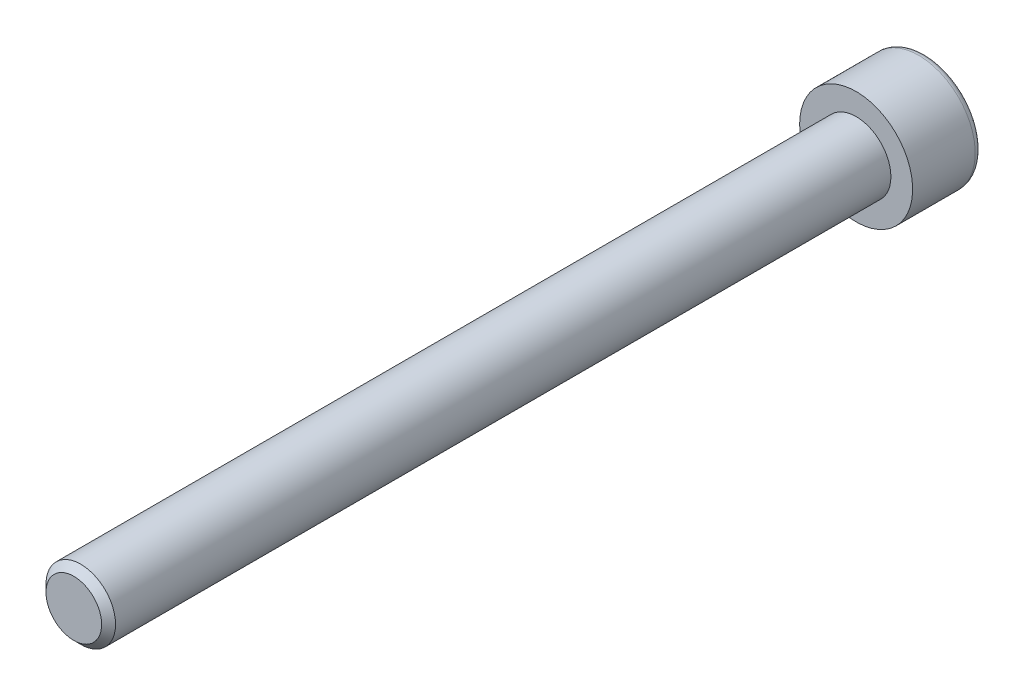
ISO-10303-21;
HEADER;
FILE_DESCRIPTION(('STEP AP214'),'2;1');
FILE_NAME('part.step','',(''),(''),'','','');
FILE_SCHEMA(('AUTOMOTIVE_DESIGN { 1 0 10303 214 1 1 1 1 }'));
ENDSEC;
DATA;
#1=APPLICATION_CONTEXT('core data for automotive mechanical design processes');
#2=APPLICATION_PROTOCOL_DEFINITION('international standard','automotive_design',2000,#1);
#3=PRODUCT_CONTEXT('',#1,'mechanical');
#4=PRODUCT('Part','Part','',(#3));
#5=PRODUCT_RELATED_PRODUCT_CATEGORY('part','',(#4));
#6=PRODUCT_DEFINITION_FORMATION('','',#4);
#7=PRODUCT_DEFINITION_CONTEXT('part definition',#1,'design');
#8=PRODUCT_DEFINITION('design','',#6,#7);
#9=PRODUCT_DEFINITION_SHAPE('','',#8);
#10=(LENGTH_UNIT() NAMED_UNIT(*) SI_UNIT(.MILLI.,.METRE.));
#11=(NAMED_UNIT(*) PLANE_ANGLE_UNIT() SI_UNIT($,.RADIAN.));
#12=(NAMED_UNIT(*) SI_UNIT($,.STERADIAN.) SOLID_ANGLE_UNIT());
#13=UNCERTAINTY_MEASURE_WITH_UNIT(LENGTH_MEASURE(1.E-05),#10,'distance_accuracy_value','');
#14=(GEOMETRIC_REPRESENTATION_CONTEXT(3) GLOBAL_UNCERTAINTY_ASSIGNED_CONTEXT((#13)) GLOBAL_UNIT_ASSIGNED_CONTEXT((#10,
#11,#12)) REPRESENTATION_CONTEXT('',''));
#15=CARTESIAN_POINT('',(0.,0.,0.));
#16=DIRECTION('',(0.,0.,1.));
#17=DIRECTION('',(1.,0.,0.));
#18=AXIS2_PLACEMENT_3D('',#15,#16,#17);
#19=CARTESIAN_POINT('',(0.,0.,-8.));
#20=DIRECTION('',(0.,0.,1.));
#21=DIRECTION('',(1.,0.,0.));
#22=AXIS2_PLACEMENT_3D('',#19,#20,#21);
#23=PLANE('',#22);
#24=CARTESIAN_POINT('',(0.,0.,-8.));
#25=DIRECTION('',(0.,0.,-1.));
#26=DIRECTION('',(-1.,0.,0.));
#27=AXIS2_PLACEMENT_3D('',#24,#25,#26);
#28=CIRCLE('',#27,5.7);
#29=CARTESIAN_POINT('',(-5.7,0.,-8.));
#30=VERTEX_POINT('',#29);
#31=EDGE_CURVE('E458',#30,#30,#28,.T.);
#32=ORIENTED_EDGE('',*,*,#31,.T.);
#33=EDGE_LOOP('',(#32));
#34=FACE_BOUND('',#33,.T.);
#35=DIRECTION('',(-0.86602540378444,0.499999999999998,0.));
#36=VECTOR('',#35,1.);
#37=CARTESIAN_POINT('',(0.,3.46410161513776,-8.));
#38=LINE('',#37,#36);
#39=CARTESIAN_POINT('',(3.,1.73205080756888,-8.));
#40=VERTEX_POINT('',#39);
#41=CARTESIAN_POINT('',(0.,3.46410161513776,-8.));
#42=VERTEX_POINT('',#41);
#43=EDGE_CURVE('E362',#40,#42,#38,.T.);
#44=ORIENTED_EDGE('',*,*,#43,.T.);
#45=DIRECTION('',(-0.866025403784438,-0.500000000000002,0.));
#46=VECTOR('',#45,1.);
#47=CARTESIAN_POINT('',(0.,3.46410161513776,-8.));
#48=LINE('',#47,#46);
#49=CARTESIAN_POINT('',(-3.,1.73205080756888,-8.));
#50=VERTEX_POINT('',#49);
#51=EDGE_CURVE('E402',#42,#50,#48,.T.);
#52=ORIENTED_EDGE('',*,*,#51,.T.);
#53=DIRECTION('',(0.,-1.,0.));
#54=VECTOR('',#53,1.);
#55=CARTESIAN_POINT('',(-3.,-1.73205080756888,-8.));
#56=LINE('',#55,#54);
#57=CARTESIAN_POINT('',(-3.,-1.73205080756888,-8.));
#58=VERTEX_POINT('',#57);
#59=EDGE_CURVE('E410',#50,#58,#56,.T.);
#60=ORIENTED_EDGE('',*,*,#59,.T.);
#61=DIRECTION('',(0.866025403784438,-0.500000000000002,0.));
#62=VECTOR('',#61,1.);
#63=CARTESIAN_POINT('',(0.,-3.46410161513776,-8.));
#64=LINE('',#63,#62);
#65=CARTESIAN_POINT('',(0.,-3.46410161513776,-8.));
#66=VERTEX_POINT('',#65);
#67=EDGE_CURVE('E428',#58,#66,#64,.T.);
#68=ORIENTED_EDGE('',*,*,#67,.T.);
#69=DIRECTION('',(0.86602540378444,0.499999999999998,0.));
#70=VECTOR('',#69,1.);
#71=CARTESIAN_POINT('',(0.,-3.46410161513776,-8.));
#72=LINE('',#71,#70);
#73=CARTESIAN_POINT('',(3.,-1.73205080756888,-8.));
#74=VERTEX_POINT('',#73);
#75=EDGE_CURVE('E431',#66,#74,#72,.T.);
#76=ORIENTED_EDGE('',*,*,#75,.T.);
#77=DIRECTION('',(0.,1.,0.));
#78=VECTOR('',#77,1.);
#79=CARTESIAN_POINT('',(3.,-1.73205080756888,-8.));
#80=LINE('',#79,#78);
#81=EDGE_CURVE('E421',#74,#40,#80,.T.);
#82=ORIENTED_EDGE('',*,*,#81,.T.);
#83=EDGE_LOOP('',(#44,#52,#60,#68,#76,#82));
#84=FACE_BOUND('',#83,.T.);
#85=ADVANCED_FACE('F348',(#34,#84),#23,.F.);
#86=CARTESIAN_POINT('',(0.,0.,-7.2));
#87=DIRECTION('',(0.,0.,-1.));
#88=DIRECTION('',(-1.,0.,0.));
#89=AXIS2_PLACEMENT_3D('',#86,#87,#88);
#90=TOROIDAL_SURFACE('',#89,5.7,0.8);
#91=ORIENTED_EDGE('',*,*,#31,.F.);
#92=EDGE_LOOP('',(#91));
#93=FACE_BOUND('',#92,.T.);
#94=CARTESIAN_POINT('',(0.,0.,-7.2));
#95=DIRECTION('',(0.,0.,-1.));
#96=DIRECTION('',(-1.,0.,0.));
#97=AXIS2_PLACEMENT_3D('',#94,#95,#96);
#98=CIRCLE('',#97,6.5);
#99=CARTESIAN_POINT('',(-6.5,0.,-7.2));
#100=VERTEX_POINT('',#99);
#101=EDGE_CURVE('E455',#100,#100,#98,.T.);
#102=ORIENTED_EDGE('',*,*,#101,.T.);
#103=EDGE_LOOP('',(#102));
#104=FACE_BOUND('',#103,.T.);
#105=ADVANCED_FACE('F477',(#93,#104),#90,.T.);
#106=CARTESIAN_POINT('',(0.,0.,0.));
#107=DIRECTION('',(0.,0.,-1.));
#108=DIRECTION('',(-1.,0.,0.));
#109=AXIS2_PLACEMENT_3D('',#106,#107,#108);
#110=CYLINDRICAL_SURFACE('',#109,6.5);
#111=ORIENTED_EDGE('',*,*,#101,.F.);
#112=EDGE_LOOP('',(#111));
#113=FACE_BOUND('',#112,.T.);
#114=CARTESIAN_POINT('',(0.,0.,0.));
#115=DIRECTION('',(0.,0.,-1.));
#116=DIRECTION('',(-1.,0.,0.));
#117=AXIS2_PLACEMENT_3D('',#114,#115,#116);
#118=CIRCLE('',#117,6.5);
#119=CARTESIAN_POINT('',(-6.5,0.,0.));
#120=VERTEX_POINT('',#119);
#121=EDGE_CURVE('E416',#120,#120,#118,.T.);
#122=ORIENTED_EDGE('',*,*,#121,.T.);
#123=EDGE_LOOP('',(#122));
#124=FACE_BOUND('',#123,.T.);
#125=ADVANCED_FACE('F482',(#113,#124),#110,.T.);
#126=CARTESIAN_POINT('',(0.,0.,0.));
#127=DIRECTION('',(0.,0.,-1.));
#128=DIRECTION('',(-1.,0.,0.));
#129=AXIS2_PLACEMENT_3D('',#126,#127,#128);
#130=PLANE('',#129);
#131=CARTESIAN_POINT('',(0.,0.,0.));
#132=DIRECTION('',(0.,0.,1.));
#133=DIRECTION('',(1.,0.,0.));
#134=AXIS2_PLACEMENT_3D('',#131,#132,#133);
#135=CIRCLE('',#134,4.);
#136=CARTESIAN_POINT('',(4.,0.,0.));
#137=VERTEX_POINT('',#136);
#138=EDGE_CURVE('E422',#137,#137,#135,.T.);
#139=ORIENTED_EDGE('',*,*,#138,.F.);
#140=EDGE_LOOP('',(#139));
#141=FACE_BOUND('',#140,.T.);
#142=ORIENTED_EDGE('',*,*,#121,.F.);
#143=EDGE_LOOP('',(#142));
#144=FACE_BOUND('',#143,.T.);
#145=ADVANCED_FACE('F490',(#141,#144),#130,.F.);
#146=CARTESIAN_POINT('',(0.,3.46410161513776,-3.7));
#147=DIRECTION('',(-0.499999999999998,-0.86602540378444,0.));
#148=DIRECTION('',(0.86602540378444,-0.499999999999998,0.));
#149=AXIS2_PLACEMENT_3D('',#146,#147,#148);
#150=PLANE('',#149);
#151=ORIENTED_EDGE('',*,*,#43,.F.);
#152=DIRECTION('',(0.,0.,-1.));
#153=VECTOR('',#152,1.);
#154=CARTESIAN_POINT('',(3.,1.73205080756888,-3.7));
#155=LINE('',#154,#153);
#156=CARTESIAN_POINT('',(3.,1.73205080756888,-3.7));
#157=VERTEX_POINT('',#156);
#158=EDGE_CURVE('E444',#157,#40,#155,.T.);
#159=ORIENTED_EDGE('',*,*,#158,.F.);
#160=DIRECTION('',(-0.86602540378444,0.499999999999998,0.));
#161=VECTOR('',#160,1.);
#162=CARTESIAN_POINT('',(0.,3.46410161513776,-3.7));
#163=LINE('',#162,#161);
#164=CARTESIAN_POINT('',(0.,3.46410161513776,-3.7));
#165=VERTEX_POINT('',#164);
#166=EDGE_CURVE('E415',#157,#165,#163,.T.);
#167=ORIENTED_EDGE('',*,*,#166,.T.);
#168=DIRECTION('',(0.,0.,-1.));
#169=VECTOR('',#168,1.);
#170=CARTESIAN_POINT('',(0.,3.46410161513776,-3.7));
#171=LINE('',#170,#169);
#172=EDGE_CURVE('E404',#165,#42,#171,.T.);
#173=ORIENTED_EDGE('',*,*,#172,.T.);
#174=EDGE_LOOP('',(#151,#159,#167,#173));
#175=FACE_BOUND('',#174,.T.);
#176=ADVANCED_FACE('F413',(#175),#150,.T.);
#177=CARTESIAN_POINT('',(0.,3.46410161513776,-3.7));
#178=DIRECTION('',(0.500000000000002,-0.866025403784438,0.));
#179=DIRECTION('',(0.866025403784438,0.500000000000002,0.));
#180=AXIS2_PLACEMENT_3D('',#177,#178,#179);
#181=PLANE('',#180);
#182=ORIENTED_EDGE('',*,*,#51,.F.);
#183=ORIENTED_EDGE('',*,*,#172,.F.);
#184=DIRECTION('',(-0.866025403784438,-0.500000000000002,0.));
#185=VECTOR('',#184,1.);
#186=CARTESIAN_POINT('',(0.,3.46410161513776,-3.7));
#187=LINE('',#186,#185);
#188=CARTESIAN_POINT('',(-3.,1.73205080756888,-3.7));
#189=VERTEX_POINT('',#188);
#190=EDGE_CURVE('E435',#165,#189,#187,.T.);
#191=ORIENTED_EDGE('',*,*,#190,.T.);
#192=DIRECTION('',(0.,0.,-1.));
#193=VECTOR('',#192,1.);
#194=CARTESIAN_POINT('',(-3.,1.73205080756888,-3.7));
#195=LINE('',#194,#193);
#196=EDGE_CURVE('E406',#189,#50,#195,.T.);
#197=ORIENTED_EDGE('',*,*,#196,.T.);
#198=EDGE_LOOP('',(#182,#183,#191,#197));
#199=FACE_BOUND('',#198,.T.);
#200=ADVANCED_FACE('F403',(#199),#181,.T.);
#201=CARTESIAN_POINT('',(-3.,-1.73205080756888,-3.7));
#202=DIRECTION('',(1.,0.,0.));
#203=DIRECTION('',(0.,0.,-1.));
#204=AXIS2_PLACEMENT_3D('',#201,#202,#203);
#205=PLANE('',#204);
#206=ORIENTED_EDGE('',*,*,#59,.F.);
#207=ORIENTED_EDGE('',*,*,#196,.F.);
#208=DIRECTION('',(0.,-1.,0.));
#209=VECTOR('',#208,1.);
#210=CARTESIAN_POINT('',(-3.,-1.73205080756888,-3.7));
#211=LINE('',#210,#209);
#212=CARTESIAN_POINT('',(-3.,-1.73205080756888,-3.7));
#213=VERTEX_POINT('',#212);
#214=EDGE_CURVE('E437',#189,#213,#211,.T.);
#215=ORIENTED_EDGE('',*,*,#214,.T.);
#216=DIRECTION('',(0.,0.,-1.));
#217=VECTOR('',#216,1.);
#218=CARTESIAN_POINT('',(-3.,-1.73205080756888,-3.7));
#219=LINE('',#218,#217);
#220=EDGE_CURVE('E450',#213,#58,#219,.T.);
#221=ORIENTED_EDGE('',*,*,#220,.T.);
#222=EDGE_LOOP('',(#206,#207,#215,#221));
#223=FACE_BOUND('',#222,.T.);
#224=ADVANCED_FACE('F505',(#223),#205,.T.);
#225=CARTESIAN_POINT('',(0.,-3.46410161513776,-3.7));
#226=DIRECTION('',(0.500000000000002,0.866025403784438,0.));
#227=DIRECTION('',(-0.866025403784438,0.500000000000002,0.));
#228=AXIS2_PLACEMENT_3D('',#225,#226,#227);
#229=PLANE('',#228);
#230=ORIENTED_EDGE('',*,*,#67,.F.);
#231=ORIENTED_EDGE('',*,*,#220,.F.);
#232=DIRECTION('',(0.866025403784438,-0.500000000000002,0.));
#233=VECTOR('',#232,1.);
#234=CARTESIAN_POINT('',(0.,-3.46410161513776,-3.7));
#235=LINE('',#234,#233);
#236=CARTESIAN_POINT('',(0.,-3.46410161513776,-3.7));
#237=VERTEX_POINT('',#236);
#238=EDGE_CURVE('E439',#213,#237,#235,.T.);
#239=ORIENTED_EDGE('',*,*,#238,.T.);
#240=DIRECTION('',(0.,0.,-1.));
#241=VECTOR('',#240,1.);
#242=CARTESIAN_POINT('',(0.,-3.46410161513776,-3.7));
#243=LINE('',#242,#241);
#244=EDGE_CURVE('E448',#237,#66,#243,.T.);
#245=ORIENTED_EDGE('',*,*,#244,.T.);
#246=EDGE_LOOP('',(#230,#231,#239,#245));
#247=FACE_BOUND('',#246,.T.);
#248=ADVANCED_FACE('F508',(#247),#229,.T.);
#249=CARTESIAN_POINT('',(0.,-3.46410161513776,-3.7));
#250=DIRECTION('',(-0.499999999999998,0.86602540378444,0.));
#251=DIRECTION('',(-0.86602540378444,-0.499999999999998,0.));
#252=AXIS2_PLACEMENT_3D('',#249,#250,#251);
#253=PLANE('',#252);
#254=ORIENTED_EDGE('',*,*,#75,.F.);
#255=ORIENTED_EDGE('',*,*,#244,.F.);
#256=DIRECTION('',(0.86602540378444,0.499999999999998,0.));
#257=VECTOR('',#256,1.);
#258=CARTESIAN_POINT('',(0.,-3.46410161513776,-3.7));
#259=LINE('',#258,#257);
#260=CARTESIAN_POINT('',(3.,-1.73205080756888,-3.7));
#261=VERTEX_POINT('',#260);
#262=EDGE_CURVE('E441',#237,#261,#259,.T.);
#263=ORIENTED_EDGE('',*,*,#262,.T.);
#264=DIRECTION('',(0.,0.,-1.));
#265=VECTOR('',#264,1.);
#266=CARTESIAN_POINT('',(3.,-1.73205080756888,-3.7));
#267=LINE('',#266,#265);
#268=EDGE_CURVE('E446',#261,#74,#267,.T.);
#269=ORIENTED_EDGE('',*,*,#268,.T.);
#270=EDGE_LOOP('',(#254,#255,#263,#269));
#271=FACE_BOUND('',#270,.T.);
#272=ADVANCED_FACE('F512',(#271),#253,.T.);
#273=CARTESIAN_POINT('',(3.,-1.73205080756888,-3.7));
#274=DIRECTION('',(-1.,0.,0.));
#275=DIRECTION('',(0.,0.,1.));
#276=AXIS2_PLACEMENT_3D('',#273,#274,#275);
#277=PLANE('',#276);
#278=ORIENTED_EDGE('',*,*,#81,.F.);
#279=ORIENTED_EDGE('',*,*,#268,.F.);
#280=DIRECTION('',(0.,1.,0.));
#281=VECTOR('',#280,1.);
#282=CARTESIAN_POINT('',(3.,-1.73205080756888,-3.7));
#283=LINE('',#282,#281);
#284=EDGE_CURVE('E369',#261,#157,#283,.T.);
#285=ORIENTED_EDGE('',*,*,#284,.T.);
#286=ORIENTED_EDGE('',*,*,#158,.T.);
#287=EDGE_LOOP('',(#278,#279,#285,#286));
#288=FACE_BOUND('',#287,.T.);
#289=ADVANCED_FACE('F516',(#288),#277,.T.);
#290=CARTESIAN_POINT('',(3.,1.73205080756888,-3.7));
#291=DIRECTION('',(0.,0.,1.));
#292=DIRECTION('',(1.,0.,0.));
#293=AXIS2_PLACEMENT_3D('',#290,#291,#292);
#294=PLANE('',#293);
#295=ORIENTED_EDGE('',*,*,#166,.F.);
#296=ORIENTED_EDGE('',*,*,#284,.F.);
#297=ORIENTED_EDGE('',*,*,#262,.F.);
#298=ORIENTED_EDGE('',*,*,#238,.F.);
#299=ORIENTED_EDGE('',*,*,#214,.F.);
#300=ORIENTED_EDGE('',*,*,#190,.F.);
#301=EDGE_LOOP('',(#295,#296,#297,#298,#299,#300));
#302=FACE_BOUND('',#301,.T.);
#303=ADVANCED_FACE('F520',(#302),#294,.F.);
#304=CARTESIAN_POINT('',(0.,0.,90.));
#305=DIRECTION('',(0.,0.,1.));
#306=DIRECTION('',(1.,0.,0.));
#307=AXIS2_PLACEMENT_3D('',#304,#305,#306);
#308=PLANE('',#307);
#309=CARTESIAN_POINT('',(0.,0.,90.));
#310=DIRECTION('',(0.,0.,1.));
#311=DIRECTION('',(1.,0.,0.));
#312=AXIS2_PLACEMENT_3D('',#309,#310,#311);
#313=CIRCLE('',#312,3.20000000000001);
#314=CARTESIAN_POINT('',(3.20000000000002,0.,90.));
#315=VERTEX_POINT('',#314);
#316=EDGE_CURVE('E355',#315,#315,#313,.T.);
#317=ORIENTED_EDGE('',*,*,#316,.T.);
#318=EDGE_LOOP('',(#317));
#319=FACE_BOUND('',#318,.T.);
#320=ADVANCED_FACE('F463',(#319),#308,.T.);
#321=CARTESIAN_POINT('',(0.,0.,0.));
#322=DIRECTION('',(0.,0.,1.));
#323=DIRECTION('',(1.,0.,0.));
#324=AXIS2_PLACEMENT_3D('',#321,#322,#323);
#325=CYLINDRICAL_SURFACE('',#324,4.);
#326=CARTESIAN_POINT('',(0.,0.,89.2));
#327=DIRECTION('',(0.,0.,1.));
#328=DIRECTION('',(1.,0.,0.));
#329=AXIS2_PLACEMENT_3D('',#326,#327,#328);
#330=CIRCLE('',#329,4.);
#331=CARTESIAN_POINT('',(4.00000000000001,0.,89.2));
#332=VERTEX_POINT('',#331);
#333=EDGE_CURVE('E11',#332,#332,#330,.F.);
#334=ORIENTED_EDGE('',*,*,#333,.T.);
#335=EDGE_LOOP('',(#334));
#336=FACE_BOUND('',#335,.T.);
#337=ORIENTED_EDGE('',*,*,#138,.T.);
#338=EDGE_LOOP('',(#337));
#339=FACE_BOUND('',#338,.T.);
#340=ADVANCED_FACE('F467',(#336,#339),#325,.T.);
#341=CARTESIAN_POINT('',(0.,0.,90.));
#342=DIRECTION('',(0.,0.,-1.));
#343=DIRECTION('',(-1.,0.,0.));
#344=AXIS2_PLACEMENT_3D('',#341,#342,#343);
#345=CONICAL_SURFACE('',#344,3.20000000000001,0.785398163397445);
#346=ORIENTED_EDGE('',*,*,#333,.F.);
#347=EDGE_LOOP('',(#346));
#348=FACE_BOUND('',#347,.T.);
#349=ORIENTED_EDGE('',*,*,#316,.F.);
#350=EDGE_LOOP('',(#349));
#351=FACE_BOUND('',#350,.T.);
#352=ADVANCED_FACE('F465',(#348,#351),#345,.T.);
#353=CLOSED_SHELL('',(#85,#105,#125,#145,#176,#200,#224,#248,#272,#289,#303,#320,#340,#352));
#354=MANIFOLD_SOLID_BREP('B2',#353);
#355=ADVANCED_BREP_SHAPE_REPRESENTATION('',(#18,#354),#14);
#356=SHAPE_DEFINITION_REPRESENTATION(#9,#355);
ENDSEC;
END-ISO-10303-21;
